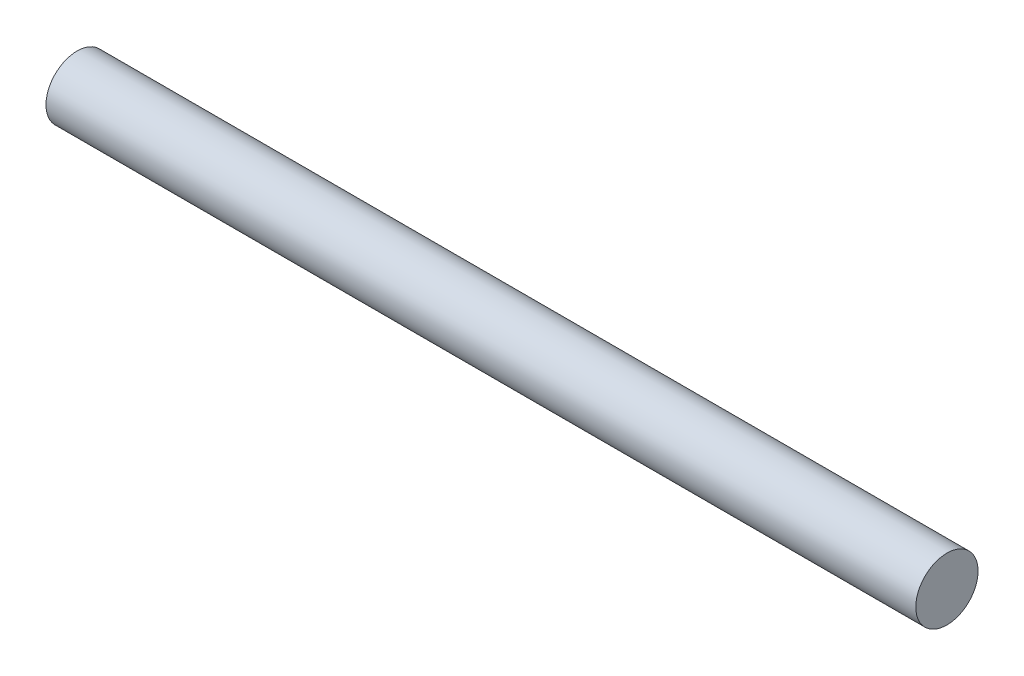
from build123d import *

# Parameters (mm, degrees)
ESQUISSE1_W = 15.20453594
ESQUISSE1_H = 0.54442596


with BuildPart() as part:
    # Esquisse1 → R_volution1 (revolve)
    with BuildSketch(Plane.XY, mode=Mode.PRIVATE) as r_volution1_sk:
        with Locations((45.346406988, 0.587946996)):
            Rectangle(ESQUISSE1_W, ESQUISSE1_H)
    revolve(r_volution1_sk.sketch.rotate(Axis((37.484479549, 0.860159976, 0), (1, 0, 0)), 270), axis=Axis((37.484479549, 0.860159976, 0), (1, 0, 0)))


solid = part.part
